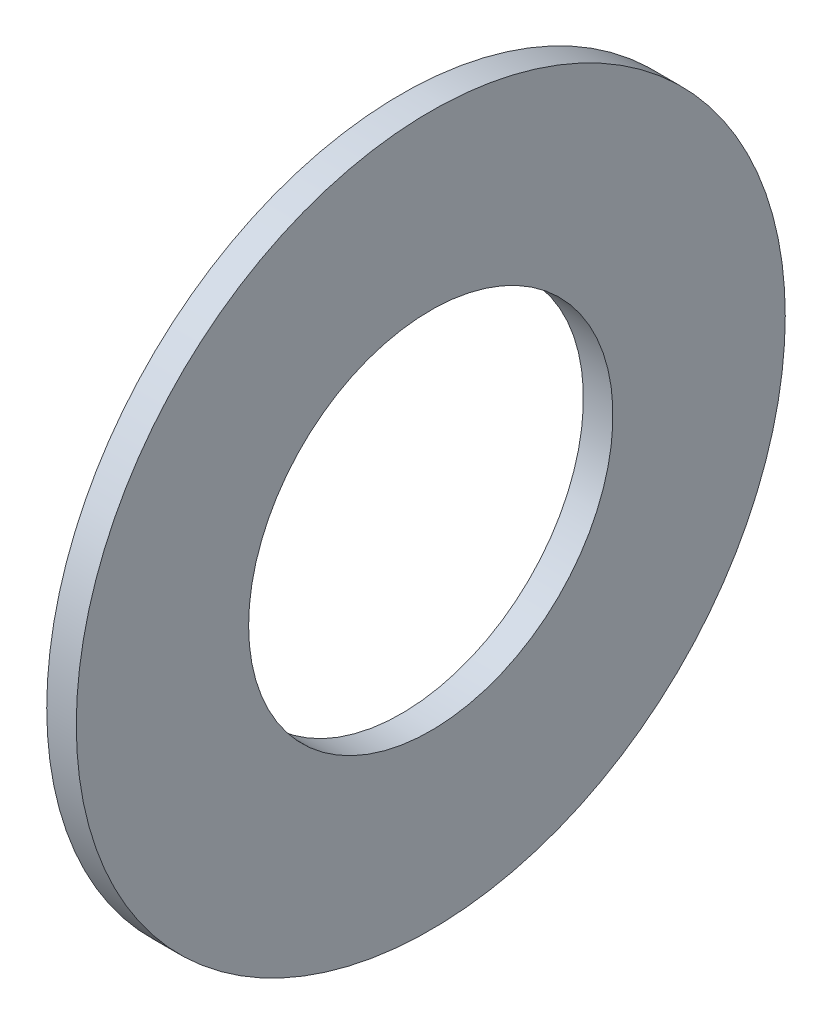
ISO-10303-21;
HEADER;
FILE_DESCRIPTION(('STEP AP214'),'2;1');
FILE_NAME('part.step','',(''),(''),'','','');
FILE_SCHEMA(('AUTOMOTIVE_DESIGN { 1 0 10303 214 1 1 1 1 }'));
ENDSEC;
DATA;
#1=APPLICATION_CONTEXT('core data for automotive mechanical design processes');
#2=APPLICATION_PROTOCOL_DEFINITION('international standard','automotive_design',2000,#1);
#3=PRODUCT_CONTEXT('',#1,'mechanical');
#4=PRODUCT('Part','Part','',(#3));
#5=PRODUCT_RELATED_PRODUCT_CATEGORY('part','',(#4));
#6=PRODUCT_DEFINITION_FORMATION('','',#4);
#7=PRODUCT_DEFINITION_CONTEXT('part definition',#1,'design');
#8=PRODUCT_DEFINITION('design','',#6,#7);
#9=PRODUCT_DEFINITION_SHAPE('','',#8);
#10=(LENGTH_UNIT() NAMED_UNIT(*) SI_UNIT(.MILLI.,.METRE.));
#11=(NAMED_UNIT(*) PLANE_ANGLE_UNIT() SI_UNIT($,.RADIAN.));
#12=(NAMED_UNIT(*) SI_UNIT($,.STERADIAN.) SOLID_ANGLE_UNIT());
#13=UNCERTAINTY_MEASURE_WITH_UNIT(LENGTH_MEASURE(1.E-05),#10,'distance_accuracy_value','');
#14=(GEOMETRIC_REPRESENTATION_CONTEXT(3) GLOBAL_UNCERTAINTY_ASSIGNED_CONTEXT((#13)) GLOBAL_UNIT_ASSIGNED_CONTEXT((#10,
#11,#12)) REPRESENTATION_CONTEXT('',''));
#15=CARTESIAN_POINT('',(0.,0.,0.));
#16=DIRECTION('',(0.,0.,1.));
#17=DIRECTION('',(1.,0.,0.));
#18=AXIS2_PLACEMENT_3D('',#15,#16,#17);
#19=CARTESIAN_POINT('',(-34.9249999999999,0.,0.));
#20=DIRECTION('',(-1.,0.,0.));
#21=DIRECTION('',(0.,0.,1.));
#22=AXIS2_PLACEMENT_3D('',#19,#20,#21);
#23=CYLINDRICAL_SURFACE('',#22,18.5);
#24=CARTESIAN_POINT('',(0.,0.,0.));
#25=DIRECTION('',(-1.,0.,0.));
#26=DIRECTION('',(0.,0.,1.));
#27=AXIS2_PLACEMENT_3D('',#24,#25,#26);
#28=CIRCLE('',#27,18.5);
#29=CARTESIAN_POINT('',(0.,0.,18.5));
#30=VERTEX_POINT('',#29);
#31=EDGE_CURVE('E10',#30,#30,#28,.T.);
#32=ORIENTED_EDGE('',*,*,#31,.F.);
#33=EDGE_LOOP('',(#32));
#34=FACE_BOUND('',#33,.T.);
#35=CARTESIAN_POINT('',(-3.,0.,0.));
#36=DIRECTION('',(-1.,0.,0.));
#37=DIRECTION('',(0.,0.,1.));
#38=AXIS2_PLACEMENT_3D('',#35,#36,#37);
#39=CIRCLE('',#38,18.5);
#40=CARTESIAN_POINT('',(-3.,0.,18.5));
#41=VERTEX_POINT('',#40);
#42=EDGE_CURVE('E51',#41,#41,#39,.T.);
#43=ORIENTED_EDGE('',*,*,#42,.T.);
#44=EDGE_LOOP('',(#43));
#45=FACE_BOUND('',#44,.T.);
#46=ADVANCED_FACE('F37',(#34,#45),#23,.F.);
#47=CARTESIAN_POINT('',(0.,18.5,0.));
#48=DIRECTION('',(-1.,0.,0.));
#49=DIRECTION('',(0.,0.,1.));
#50=AXIS2_PLACEMENT_3D('',#47,#48,#49);
#51=PLANE('',#50);
#52=CARTESIAN_POINT('',(0.,0.,0.));
#53=DIRECTION('',(-1.,0.,0.));
#54=DIRECTION('',(0.,0.,1.));
#55=AXIS2_PLACEMENT_3D('',#52,#53,#54);
#56=CIRCLE('',#55,36.);
#57=CARTESIAN_POINT('',(0.,0.,36.));
#58=VERTEX_POINT('',#57);
#59=EDGE_CURVE('E43',#58,#58,#56,.T.);
#60=ORIENTED_EDGE('',*,*,#59,.F.);
#61=EDGE_LOOP('',(#60));
#62=FACE_BOUND('',#61,.T.);
#63=ORIENTED_EDGE('',*,*,#31,.T.);
#64=EDGE_LOOP('',(#63));
#65=FACE_BOUND('',#64,.T.);
#66=ADVANCED_FACE('F66',(#62,#65),#51,.F.);
#67=CARTESIAN_POINT('',(-34.9249999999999,0.,0.));
#68=DIRECTION('',(-1.,0.,0.));
#69=DIRECTION('',(0.,0.,1.));
#70=AXIS2_PLACEMENT_3D('',#67,#68,#69);
#71=CYLINDRICAL_SURFACE('',#70,36.);
#72=CARTESIAN_POINT('',(-3.,0.,0.));
#73=DIRECTION('',(-1.,0.,0.));
#74=DIRECTION('',(0.,0.,1.));
#75=AXIS2_PLACEMENT_3D('',#72,#73,#74);
#76=CIRCLE('',#75,36.);
#77=CARTESIAN_POINT('',(-3.,0.,36.));
#78=VERTEX_POINT('',#77);
#79=EDGE_CURVE('E47',#78,#78,#76,.T.);
#80=ORIENTED_EDGE('',*,*,#79,.F.);
#81=EDGE_LOOP('',(#80));
#82=FACE_BOUND('',#81,.T.);
#83=ORIENTED_EDGE('',*,*,#59,.T.);
#84=EDGE_LOOP('',(#83));
#85=FACE_BOUND('',#84,.T.);
#86=ADVANCED_FACE('F61',(#82,#85),#71,.T.);
#87=CARTESIAN_POINT('',(-3.,36.,0.));
#88=DIRECTION('',(1.,0.,0.));
#89=DIRECTION('',(0.,0.,-1.));
#90=AXIS2_PLACEMENT_3D('',#87,#88,#89);
#91=PLANE('',#90);
#92=ORIENTED_EDGE('',*,*,#42,.F.);
#93=EDGE_LOOP('',(#92));
#94=FACE_BOUND('',#93,.T.);
#95=ORIENTED_EDGE('',*,*,#79,.T.);
#96=EDGE_LOOP('',(#95));
#97=FACE_BOUND('',#96,.T.);
#98=ADVANCED_FACE('F58',(#94,#97),#91,.F.);
#99=CLOSED_SHELL('',(#46,#66,#86,#98));
#100=MANIFOLD_SOLID_BREP('B2',#99);
#101=ADVANCED_BREP_SHAPE_REPRESENTATION('',(#18,#100),#14);
#102=SHAPE_DEFINITION_REPRESENTATION(#9,#101);
ENDSEC;
END-ISO-10303-21;
